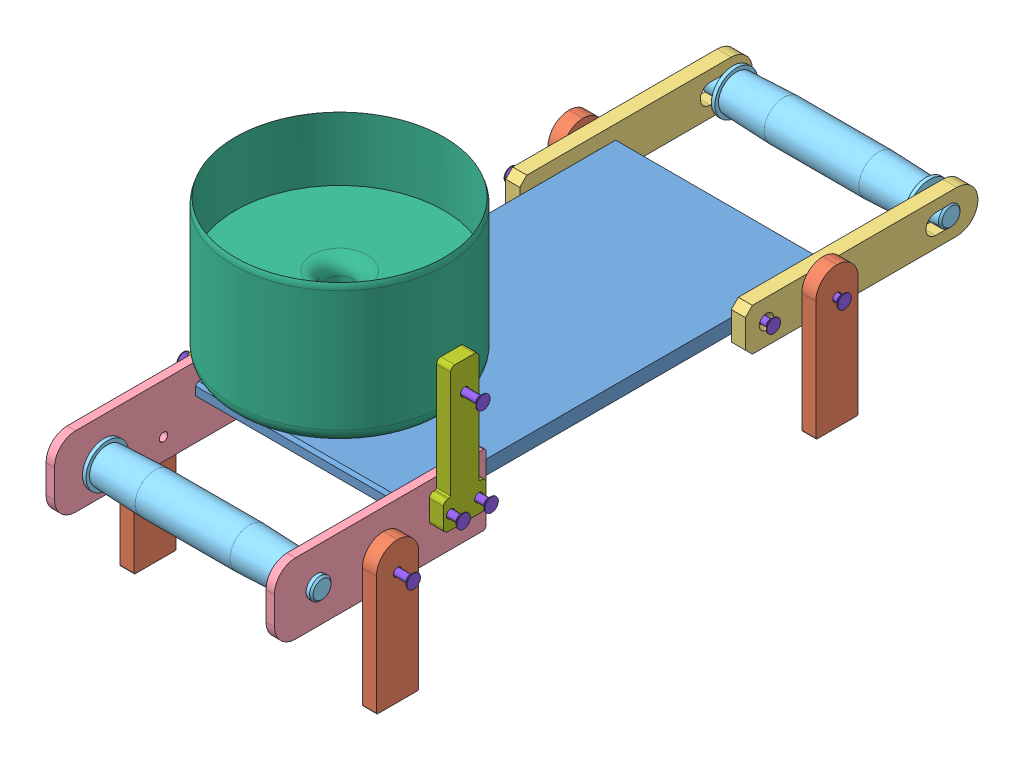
SolidWorks assembly EnsamblajeProyecto.SLDASM, configuration Predeterminado (file format 9000). Lengths in mm.
Overall size (206.25 242 495).
26 component instances, 8 part files, 46 mates.
Components (placement in the parent):
- Pieza6arreglada-2: Pieza6arreglada.SLDPRT [Predeterminado] at (-12.013 300 207.8597) size (150 10 300)
- Pieza4-1: Pieza4.SLDPRT [Predeterminado] at (-6.013 197.5 245.5033) x (0 0 -1) z (0 -1 0) size (30 10 100)
- Pieza3arreglada-1: Pieza3arreglada.SLDPRT [Predeterminado] at (-8.013 306.7595 160.1754) size (10 30 165)
- Pieza3arreglada-2: Pieza3arreglada.SLDPRT [Predeterminado] at (-168.013 306.7595 160.1754) size (10 30 165)
- Pieza1arreglada-1: Pieza1arreglada.SLDPRT [Predeterminado] at (-12.013 312.5 157.8597) size (6 50 150)
- Pieza1arreglada-2: Pieza1arreglada.SLDPRT [Predeterminado] at (-168.013 312.5 157.8597) size (6 50 150)
- Pieza4-2: Pieza4.SLDPRT [Predeterminado] at (7.987 214.5 -92.1403) x (0 0 1) z (0 -1 0) size (30 10 100)
- Pieza4-3: Pieza4.SLDPRT [Predeterminado] at (-178.013 197.5 245.5033) x (0 0 -1) z (0 -1 0) size (30 10 100)
- Pieza4-4: Pieza4.SLDPRT [Predeterminado] at (-172.013 214.5 -92.1403) x (0 0 1) z (0 -1 0) size (30 10 100)
- Pieza9-1: Pieza9.SLDPRT [Predeterminado] at (-16.3765 356.2069 126.7763) x (1 0 0) z (0 0.15977 0.987154) size (170 30.45 30.45)
- Pieza9-2: Pieza9.SLDPRT [Predeterminado] at (-17.4476 81.5953 496.4872) x (1 0 0) z (0 -0.718694 0.695327) size (170 30.45 30.45)
- DEPOSITO-1: DEPOSITO.SLDPRT [Predeterminado] at (-84.7454 339.5 182.8597) x (0 0 -1) z (1 0 0) size (150 120 150)
- Pieza10-1: Pieza10.SLDPRT [Predeterminado] at (3.987 284.5 167.8597) x (0 0 1) z (0 -1 0) size (30 10 100)
- Pieza10-2: Pieza10.SLDPRT [Predeterminado] at (-168.013 284.5 167.8597) x (0 0 1) z (0 -1 0) size (30 10 100)
- Pieza7arreglada-1: Pieza7arreglada.SLDPRT [Predeterminado] at (6.8891 321.4441 423.9782) x (1 0 0) z (0 0.085006 0.99638) size (16 9.64 9.64)
- Pieza7arreglada-2: Pieza7arreglada.SLDPRT [Predeterminado] at (7.0978 508.6019 326.8256) x (1 0 0) z (0 0.835975 0.548767) size (16 9.64 9.64)
- Pieza7arreglada-3: Pieza7arreglada.SLDPRT [Predeterminado] at (-2.9665 526.1035 -137.8692) x (1 0 0) z (0 0.925492 -0.378767) size (16 9.64 9.64)
- Pieza7arreglada-4: Pieza7arreglada.SLDPRT [Predeterminado] at (9.2764 389.9966 456.625) x (1 0 0) z (0 0.425823 0.904807) size (16 9.64 9.64)
- Pieza7arreglada-5: Pieza7arreglada.SLDPRT [Predeterminado] at (11.0451 440.8539 423.6014) x (1 0 0) z (0 0.28149 0.959564) size (16 9.64 9.64)
- Pieza7arreglada-6: Pieza7arreglada.SLDPRT [Predeterminado] at (7.2215 542.8552 -31.2468) x (1 0 0) z (0 0.979161 0.203085) size (16 9.64 9.64)
- Pieza7arreglada-7: Pieza7arreglada.SLDPRT [Predeterminado] at (-178.6507 173.5698 348.184) x (-1 0 0) z (0 -0.741546 0.670902) size (16 9.64 9.64)
- Pieza7arreglada-8: Pieza7arreglada.SLDPRT [Predeterminado] at (-179.3236 129.1259 383.7468) x (-1 0 0) z (0 -0.638177 0.76989) size (16 9.64 9.64)
- Pieza7arreglada-9: Pieza7arreglada.SLDPRT [Predeterminado] at (-179.4041 209.1679 410.5673) x (-1 0 0) z (0 -0.317292 0.948328) size (16 9.64 9.64)
- Pieza7arreglada-10: Pieza7arreglada.SLDPRT [Predeterminado] at (-179.2578 74.1098 380.2329) x (-1 0 0) z (0 -0.792213 0.610244) size (16 9.64 9.64)
- Pieza7arreglada-11: Pieza7arreglada.SLDPRT [Predeterminado] at (-183.0097 399.3734 -306.8969) x (-1 0 0) z (0 0.395332 -0.918538) size (16 9.64 9.64)
- Pieza7arreglada-12: Pieza7arreglada.SLDPRT [Predeterminado] at (-177.1795 99.7312 123.644) x (-1 0 0) z (0 -0.757132 0.653262) size (16 9.64 9.64)
Mates (geometry in assembly coordinates):
- Concéntrica1: concentric aligned: circle of Pieza6arreglada-2; circle of Pieza1arreglada-1
- Concéntrica2: concentric aligned: circle of Pieza6arreglada-2; circle of Pieza1arreglada-1
- Concéntrica3: concentric aligned: circle of Pieza6arreglada-2; circle of Pieza1arreglada-2
- Concéntrica4: concentric aligned: circle of Pieza6arreglada-2; circle of Pieza1arreglada-2
- Tangente2: tangent: circle of Pieza6arreglada-2; plane of Pieza1arreglada-1 through (-12.013 312.5 157.8597) normal (-1 0 0)
- Tangente3: tangent: circle of Pieza6arreglada-2; plane of Pieza1arreglada-2 through (-162.013 312.5 157.8597) normal (1 0 0)
- Concéntrica5: concentric anti-aligned: circle of Pieza4-1; circle of Pieza1arreglada-1
- Paralelo1: parallel aligned: plane of Pieza4-1 through (3.987 197.5 245.5033) normal (0 -1 0); plane of Pieza1arreglada-1 through (-12.013 262.5 307.8597) normal (0 -1 0)
- Tangente4: tangent: plane of Pieza4-1 through (-6.013 197.5 245.5033) normal (-1 0 0); circle of Pieza1arreglada-1
- Concéntrica6: concentric aligned: circle of Pieza6arreglada-2; circle of Pieza3arreglada-1
- Concéntrica7: concentric aligned: circle of Pieza6arreglada-2; circle of Pieza3arreglada-1
- Tangente5: tangent: plane of Pieza6arreglada-2 through (-12.013 289.5 207.8597) normal (1 0 0); circle of Pieza3arreglada-1
- Concéntrica8: concentric aligned: circle of Pieza6arreglada-2; circle of Pieza3arreglada-2
- Concéntrica9: concentric aligned: circle of Pieza6arreglada-2; circle of Pieza3arreglada-2
- Tangente6: tangent: circle of Pieza6arreglada-2; plane of Pieza3arreglada-2 through (-162.013 294.5 -172.1403) normal (1 0 0)
- Concéntrica10: concentric anti-aligned: circle of Pieza3arreglada-1; circle of Pieza4-2
- Paralelo2: parallel aligned: plane of Pieza3arreglada-1 through (-12.013 279.5 -22.1403) normal (0 -1 0); plane of Pieza4-2 through (-2.013 214.5 -92.1403) normal (0 -1 0)
- Tangente7: tangent: plane of Pieza3arreglada-1 through (-2.013 294.5 -172.1403) normal (1 0 0); circle of Pieza4-2
- Concéntrica11: concentric anti-aligned: circle of Pieza3arreglada-2; circle of Pieza4-4
- Paralelo3: parallel aligned: plane of Pieza6arreglada-2 through (-12.013 289.5 207.8597) normal (0 -1 0); plane of Pieza4-4 through (-182.013 214.5 -92.1403) normal (0 -1 0)
- Concéntrica12: concentric anti-aligned: circle of Pieza1arreglada-2; circle of Pieza4-3
- Paralelo4: parallel aligned: plane of Pieza6arreglada-2 through (-12.013 289.5 207.8597) normal (0 -1 0); plane of Pieza4-3 through (-168.013 197.5 245.5033) normal (0 -1 0)
- Tangente8: tangent: circle of Pieza1arreglada-2; plane of Pieza4-3 through (-168.013 197.5 245.5033) normal (1 0 0)
- Tangente9: tangent: plane of Pieza3arreglada-2 through (-172.013 294.5 -172.1403) normal (-1 0 0); circle of Pieza4-4
- Concéntrica13: concentric aligned: circle of Pieza3arreglada-1; circle of Pieza9-1
- Concéntrica14: concentric anti-aligned: circle of Pieza1arreglada-1; circle of Pieza9-2
- Concéntrica15: concentric anti-aligned: circle of Pieza1arreglada-1; circle of Pieza10-1
- Concéntrica16: concentric anti-aligned: circle of Pieza1arreglada-1; circle of Pieza10-1
- Concéntrica17: concentric anti-aligned: circle of Pieza1arreglada-2; circle of Pieza10-2
- Concéntrica18: concentric anti-aligned: circle of Pieza1arreglada-2; circle of Pieza10-2
- Tangente10: tangent: circle of Pieza1arreglada-1; plane of Pieza10-1 through (-6.013 381.5 189.8597) normal (-1 0 0)
- Tangente11: tangent: circle of Pieza1arreglada-2; plane of Pieza10-2 through (-168.013 381.5 189.8597) normal (1 0 0)
- Concéntrica19: concentric anti-aligned: cylinder of DEPOSITO-1 through (-159.7454 364.5 182.8597) axis (1 0 0) radius 5; circle of Pieza10-1
- Paralelo5: parallel aligned: plane of Pieza6arreglada-2 through (-12.013 299.5 207.8597) normal (0 1 0); plane of DEPOSITO-1 through (-84.7454 394.5 182.8597) normal (0 1 0)
- Concéntrica20: concentric anti-aligned: circle of Pieza10-1; circle of Pieza7arreglada-2
- Concéntrica21: concentric anti-aligned: circle of Pieza10-1; circle of Pieza7arreglada-1
- Concéntrica22: concentric aligned: circle of Pieza4-1; circle of Pieza7arreglada-4
- Concéntrica23: concentric anti-aligned: circle of Pieza10-1; circle of Pieza7arreglada-5
- Concéntrica24: concentric aligned: circle of Pieza3arreglada-1; circle of Pieza7arreglada-3
- Concéntrica25: concentric aligned: circle of Pieza4-2; circle of Pieza7arreglada-6
- Concéntrica26: concentric aligned: circle of Pieza4-3; circle of Pieza7arreglada-10
- Concéntrica27: concentric aligned: circle of Pieza10-2; circle of Pieza7arreglada-8
- Concéntrica28: concentric aligned: circle of Pieza10-2; circle of Pieza7arreglada-9
- Concéntrica29: concentric aligned: cylinder of Pieza10-2 through (-168.013 364.5 182.8597) axis (-1 0 0) radius 3; circle of Pieza7arreglada-7
- Concéntrica30: concentric aligned: circle of Pieza4-4; circle of Pieza7arreglada-11
- Concéntrica31: concentric anti-aligned: circle of Pieza3arreglada-2; circle of Pieza7arreglada-12
